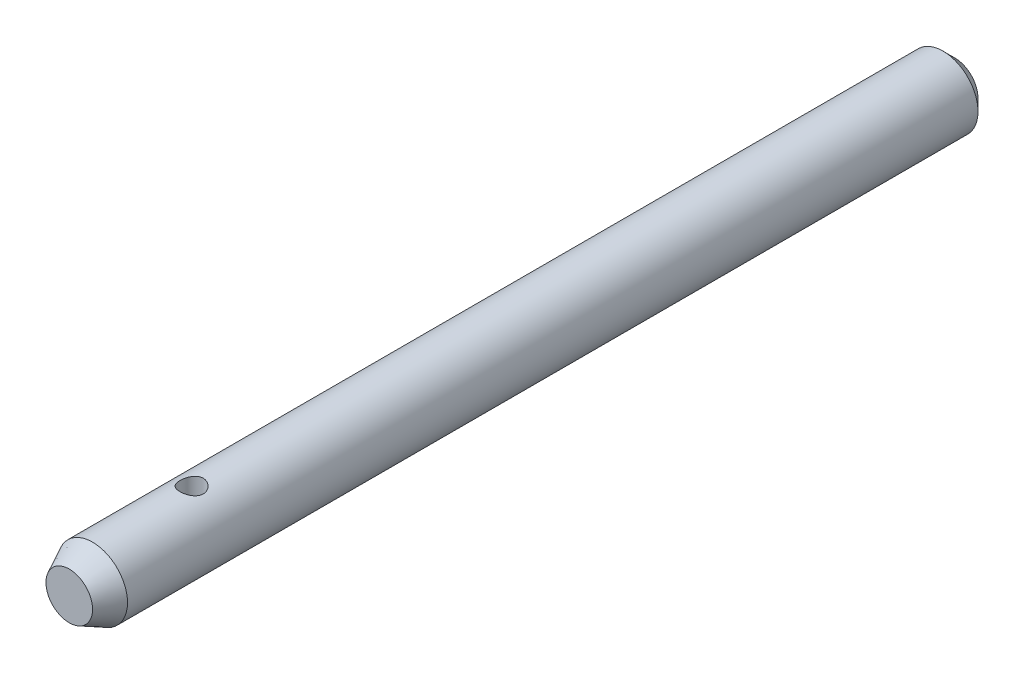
from build123d import *

# Parameters (mm, degrees)
ESQUISSE1_R             = 3
BASE_EXTRUSION_DEPTH    = 76
CHANFREIN1_SIZE         = 2
CHANFREIN1_SIZE2        = 1
CHANFREIN2_SIZE         = 1
ESQUISSE2_R             = 1
ENL_V_MAT_EXTRU_1_DEPTH = 5


with BuildPart() as part:
    # Esquisse1 → Base-Extrusion (new body)
    with BuildSketch(Plane.XY):
        Circle(ESQUISSE1_R)
    extrude(amount=BASE_EXTRUSION_DEPTH)

    # Chanfrein1
    chanfrein1_edges = [part.edges().sort_by_distance(p)[0] for p in [
        (-3, 0, 76),
    ]]
    chanfrein1_side = [part.faces().sort_by_distance(p)[0] for p in [
        (-3, 0, 38),
    ]]
    chamfer(chanfrein1_edges, length=CHANFREIN1_SIZE, length2=CHANFREIN1_SIZE2, reference=chanfrein1_side[0])

    # Chanfrein2
    chanfrein2_edges = [part.edges().sort_by_distance(p)[0] for p in [
        (-3, 0, 0),
    ]]
    chamfer(chanfrein2_edges, length=CHANFREIN2_SIZE)

    # Esquisse2 → Enl_v. mat.-Extru.1 (cut, symmetric)
    with BuildSketch(Plane(origin=(0, 0, 0), x_dir=(1, 0, 0), z_dir=(0, 1, 0))):
        with Locations(Location((0, -65.5, 0), (0, 0, 270))):
            Circle(ESQUISSE2_R)
    extrude(amount=ENL_V_MAT_EXTRU_1_DEPTH, both=True, mode=Mode.SUBTRACT)


solid = part.part
